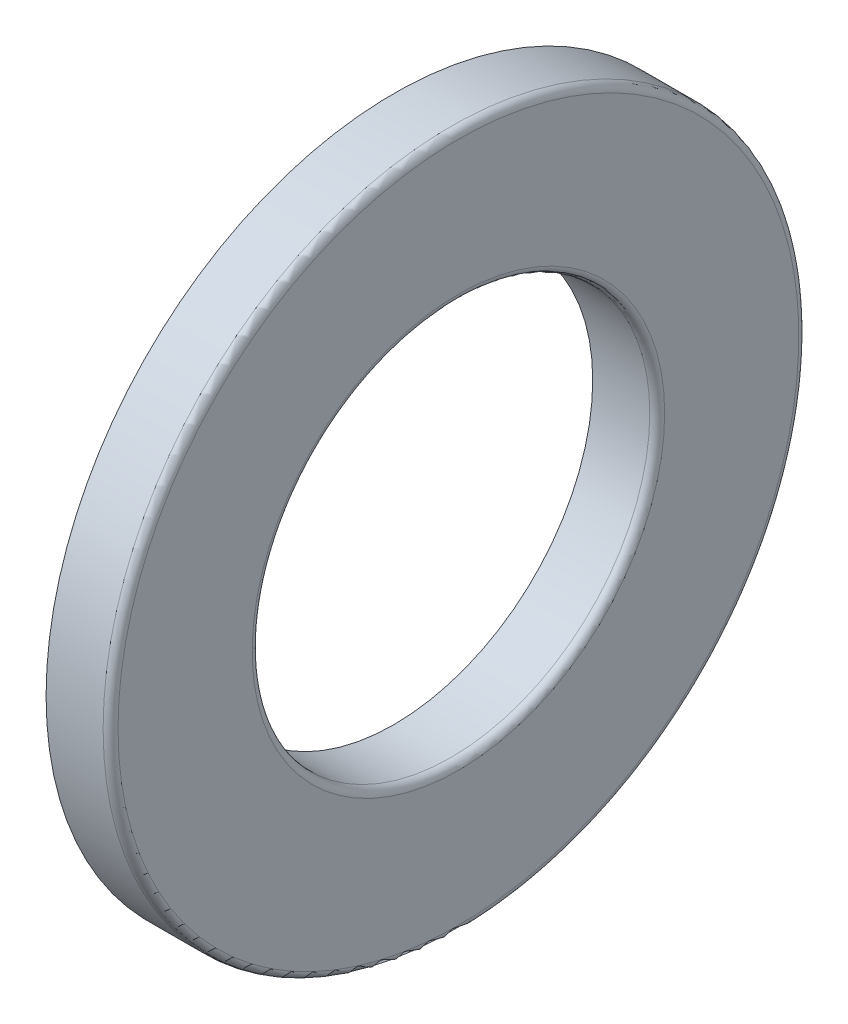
ISO-10303-21;
HEADER;
FILE_DESCRIPTION(('STEP AP214'),'2;1');
FILE_NAME('part.step','',(''),(''),'','','');
FILE_SCHEMA(('AUTOMOTIVE_DESIGN { 1 0 10303 214 1 1 1 1 }'));
ENDSEC;
DATA;
#1=APPLICATION_CONTEXT('core data for automotive mechanical design processes');
#2=APPLICATION_PROTOCOL_DEFINITION('international standard','automotive_design',2000,#1);
#3=PRODUCT_CONTEXT('',#1,'mechanical');
#4=PRODUCT('Part','Part','',(#3));
#5=PRODUCT_RELATED_PRODUCT_CATEGORY('part','',(#4));
#6=PRODUCT_DEFINITION_FORMATION('','',#4);
#7=PRODUCT_DEFINITION_CONTEXT('part definition',#1,'design');
#8=PRODUCT_DEFINITION('design','',#6,#7);
#9=PRODUCT_DEFINITION_SHAPE('','',#8);
#10=(LENGTH_UNIT() NAMED_UNIT(*) SI_UNIT(.MILLI.,.METRE.));
#11=(NAMED_UNIT(*) PLANE_ANGLE_UNIT() SI_UNIT($,.RADIAN.));
#12=(NAMED_UNIT(*) SI_UNIT($,.STERADIAN.) SOLID_ANGLE_UNIT());
#13=UNCERTAINTY_MEASURE_WITH_UNIT(LENGTH_MEASURE(1.E-05),#10,'distance_accuracy_value','');
#14=(GEOMETRIC_REPRESENTATION_CONTEXT(3) GLOBAL_UNCERTAINTY_ASSIGNED_CONTEXT((#13)) GLOBAL_UNIT_ASSIGNED_CONTEXT((#10,
#11,#12)) REPRESENTATION_CONTEXT('',''));
#15=CARTESIAN_POINT('',(0.,0.,0.));
#16=DIRECTION('',(0.,0.,1.));
#17=DIRECTION('',(1.,0.,0.));
#18=AXIS2_PLACEMENT_3D('',#15,#16,#17);
#19=CARTESIAN_POINT('',(6.4048,-14.260068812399,-14.));
#20=DIRECTION('',(-1.,0.,0.));
#21=DIRECTION('',(0.,0.,1.));
#22=AXIS2_PLACEMENT_3D('',#19,#20,#21);
#23=PLANE('',#22);
#24=CARTESIAN_POINT('',(6.4048,0.,0.));
#25=DIRECTION('',(-1.,0.,0.));
#26=DIRECTION('',(0.,0.,-1.));
#27=AXIS2_PLACEMENT_3D('',#24,#25,#26);
#28=CIRCLE('',#27,14.);
#29=CARTESIAN_POINT('',(6.4048,0.,-14.));
#30=VERTEX_POINT('',#29);
#31=EDGE_CURVE('E44',#30,#30,#28,.F.);
#32=ORIENTED_EDGE('',*,*,#31,.F.);
#33=EDGE_LOOP('',(#32));
#34=FACE_BOUND('',#33,.T.);
#35=CARTESIAN_POINT('',(6.4048,0.,0.));
#36=DIRECTION('',(1.,0.,0.));
#37=DIRECTION('',(0.,0.,1.));
#38=AXIS2_PLACEMENT_3D('',#35,#36,#37);
#39=CIRCLE('',#38,12.1786);
#40=CARTESIAN_POINT('',(6.4048,0.,12.1786));
#41=VERTEX_POINT('',#40);
#42=EDGE_CURVE('E41',#41,#41,#39,.T.);
#43=ORIENTED_EDGE('',*,*,#42,.T.);
#44=EDGE_LOOP('',(#43));
#45=FACE_BOUND('',#44,.T.);
#46=ADVANCED_FACE('F15',(#34,#45),#23,.T.);
#47=CARTESIAN_POINT('',(9.,-13.9544959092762,13.7));
#48=DIRECTION('',(1.,0.,0.));
#49=DIRECTION('',(0.,0.,-1.));
#50=AXIS2_PLACEMENT_3D('',#47,#48,#49);
#51=PLANE('',#50);
#52=CARTESIAN_POINT('',(9.,0.,0.));
#53=DIRECTION('',(1.,0.,0.));
#54=DIRECTION('',(0.,0.,1.));
#55=AXIS2_PLACEMENT_3D('',#52,#53,#54);
#56=CIRCLE('',#55,13.7);
#57=CARTESIAN_POINT('',(9.,0.,13.7));
#58=VERTEX_POINT('',#57);
#59=EDGE_CURVE('E38',#58,#58,#56,.T.);
#60=ORIENTED_EDGE('',*,*,#59,.T.);
#61=EDGE_LOOP('',(#60));
#62=FACE_BOUND('',#61,.T.);
#63=CARTESIAN_POINT('',(9.,0.,0.));
#64=DIRECTION('',(-1.,0.,0.));
#65=DIRECTION('',(0.,0.,-1.));
#66=AXIS2_PLACEMENT_3D('',#63,#64,#65);
#67=CIRCLE('',#66,8.3);
#68=CARTESIAN_POINT('',(9.,0.,-8.3));
#69=VERTEX_POINT('',#68);
#70=EDGE_CURVE('E35',#69,#69,#67,.F.);
#71=ORIENTED_EDGE('',*,*,#70,.F.);
#72=EDGE_LOOP('',(#71));
#73=FACE_BOUND('',#72,.T.);
#74=ADVANCED_FACE('F53',(#62,#73),#51,.T.);
#75=CARTESIAN_POINT('',(6.4048,-9.57609753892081,-9.3214));
#76=DIRECTION('',(-1.,0.,0.));
#77=DIRECTION('',(0.,0.,1.));
#78=AXIS2_PLACEMENT_3D('',#75,#76,#77);
#79=PLANE('',#78);
#80=CARTESIAN_POINT('',(6.4048,0.,0.));
#81=DIRECTION('',(-1.,0.,0.));
#82=DIRECTION('',(0.,0.,-1.));
#83=AXIS2_PLACEMENT_3D('',#80,#81,#82);
#84=CIRCLE('',#83,9.3214);
#85=CARTESIAN_POINT('',(6.4048,0.,-9.3214));
#86=VERTEX_POINT('',#85);
#87=EDGE_CURVE('E30',#86,#86,#84,.F.);
#88=ORIENTED_EDGE('',*,*,#87,.F.);
#89=EDGE_LOOP('',(#88));
#90=FACE_BOUND('',#89,.T.);
#91=CARTESIAN_POINT('',(6.4048,0.,0.));
#92=DIRECTION('',(1.,0.,0.));
#93=DIRECTION('',(0.,0.,1.));
#94=AXIS2_PLACEMENT_3D('',#91,#92,#93);
#95=CIRCLE('',#94,8.);
#96=CARTESIAN_POINT('',(6.4048,0.,8.));
#97=VERTEX_POINT('',#96);
#98=EDGE_CURVE('E26',#97,#97,#95,.T.);
#99=ORIENTED_EDGE('',*,*,#98,.T.);
#100=EDGE_LOOP('',(#99));
#101=FACE_BOUND('',#100,.T.);
#102=ADVANCED_FACE('F60',(#90,#101),#79,.T.);
#103=CARTESIAN_POINT('',(4.5,0.,0.));
#104=DIRECTION('',(1.,0.,0.));
#105=DIRECTION('',(0.,0.,1.));
#106=AXIS2_PLACEMENT_3D('',#103,#104,#105);
#107=TOROIDAL_SURFACE('',#106,10.75,2.381);
#108=ORIENTED_EDGE('',*,*,#42,.F.);
#109=EDGE_LOOP('',(#108));
#110=FACE_BOUND('',#109,.T.);
#111=ORIENTED_EDGE('',*,*,#87,.T.);
#112=EDGE_LOOP('',(#111));
#113=FACE_BOUND('',#112,.T.);
#114=ADVANCED_FACE('F57',(#110,#113),#107,.F.);
#115=CARTESIAN_POINT('',(8.7,0.,0.));
#116=DIRECTION('',(1.,0.,0.));
#117=DIRECTION('',(0.,1.92336047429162E-10,1.));
#118=AXIS2_PLACEMENT_3D('',#115,#116,#117);
#119=CYLINDRICAL_SURFACE('',#118,14.);
#120=ORIENTED_EDGE('',*,*,#31,.T.);
#121=EDGE_LOOP('',(#120));
#122=FACE_BOUND('',#121,.T.);
#123=CARTESIAN_POINT('',(8.7,0.,0.));
#124=DIRECTION('',(-1.,0.,0.));
#125=DIRECTION('',(0.,0.,-1.));
#126=AXIS2_PLACEMENT_3D('',#123,#124,#125);
#127=CIRCLE('',#126,14.);
#128=CARTESIAN_POINT('',(8.7,0.,-14.));
#129=VERTEX_POINT('',#128);
#130=EDGE_CURVE('E22',#129,#129,#127,.F.);
#131=ORIENTED_EDGE('',*,*,#130,.F.);
#132=EDGE_LOOP('',(#131));
#133=FACE_BOUND('',#132,.T.);
#134=ADVANCED_FACE('F48',(#122,#133),#119,.T.);
#135=CARTESIAN_POINT('',(8.70000000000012,0.,0.));
#136=DIRECTION('',(1.,0.,0.));
#137=DIRECTION('',(0.,1.92336047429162E-10,1.));
#138=AXIS2_PLACEMENT_3D('',#135,#136,#137);
#139=TOROIDAL_SURFACE('',#138,13.7000000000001,0.299999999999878);
#140=ORIENTED_EDGE('',*,*,#130,.T.);
#141=EDGE_LOOP('',(#140));
#142=FACE_BOUND('',#141,.T.);
#143=ORIENTED_EDGE('',*,*,#59,.F.);
#144=EDGE_LOOP('',(#143));
#145=FACE_BOUND('',#144,.T.);
#146=ADVANCED_FACE('F75',(#142,#145),#139,.T.);
#147=CARTESIAN_POINT('',(8.70000000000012,0.,0.));
#148=DIRECTION('',(1.,0.,0.));
#149=DIRECTION('',(0.,0.,1.));
#150=AXIS2_PLACEMENT_3D('',#147,#148,#149);
#151=TOROIDAL_SURFACE('',#150,8.29999999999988,0.299999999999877);
#152=ORIENTED_EDGE('',*,*,#70,.T.);
#153=EDGE_LOOP('',(#152));
#154=FACE_BOUND('',#153,.T.);
#155=CARTESIAN_POINT('',(8.7,0.,0.));
#156=DIRECTION('',(-1.,0.,0.));
#157=DIRECTION('',(0.,0.,-1.));
#158=AXIS2_PLACEMENT_3D('',#155,#156,#157);
#159=CIRCLE('',#158,8.);
#160=CARTESIAN_POINT('',(8.7,0.,-8.));
#161=VERTEX_POINT('',#160);
#162=EDGE_CURVE('E10',#161,#161,#159,.F.);
#163=ORIENTED_EDGE('',*,*,#162,.F.);
#164=EDGE_LOOP('',(#163));
#165=FACE_BOUND('',#164,.T.);
#166=ADVANCED_FACE('F70',(#154,#165),#151,.T.);
#167=CARTESIAN_POINT('',(8.7,0.,0.));
#168=DIRECTION('',(1.,0.,0.));
#169=DIRECTION('',(0.,0.,1.));
#170=AXIS2_PLACEMENT_3D('',#167,#168,#169);
#171=CYLINDRICAL_SURFACE('',#170,8.);
#172=ORIENTED_EDGE('',*,*,#162,.T.);
#173=EDGE_LOOP('',(#172));
#174=FACE_BOUND('',#173,.T.);
#175=ORIENTED_EDGE('',*,*,#98,.F.);
#176=EDGE_LOOP('',(#175));
#177=FACE_BOUND('',#176,.T.);
#178=ADVANCED_FACE('F17',(#174,#177),#171,.F.);
#179=CLOSED_SHELL('',(#46,#74,#102,#114,#134,#146,#166,#178));
#180=MANIFOLD_SOLID_BREP('B1',#179);
#181=ADVANCED_BREP_SHAPE_REPRESENTATION('',(#18,#180),#14);
#182=SHAPE_DEFINITION_REPRESENTATION(#9,#181);
ENDSEC;
END-ISO-10303-21;
